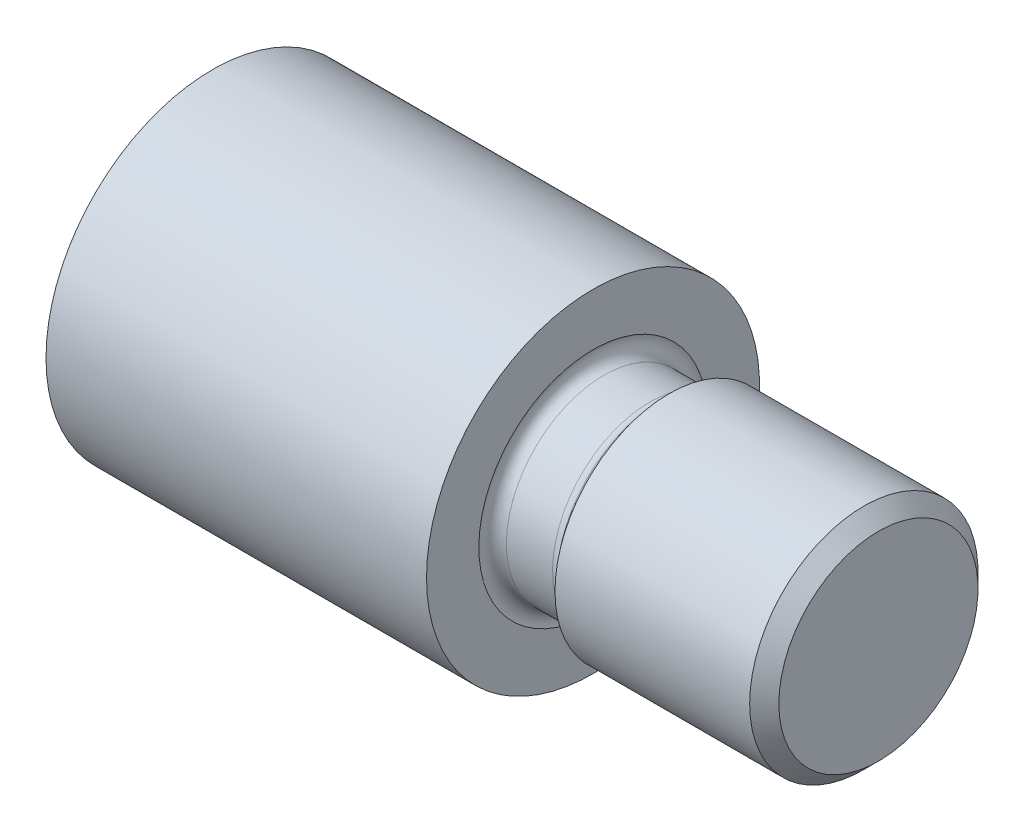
ISO-10303-21;
HEADER;
FILE_DESCRIPTION(('STEP AP214'),'2;1');
FILE_NAME('part.step','',(''),(''),'','','');
FILE_SCHEMA(('AUTOMOTIVE_DESIGN { 1 0 10303 214 1 1 1 1 }'));
ENDSEC;
DATA;
#1=APPLICATION_CONTEXT('core data for automotive mechanical design processes');
#2=APPLICATION_PROTOCOL_DEFINITION('international standard','automotive_design',2000,#1);
#3=PRODUCT_CONTEXT('',#1,'mechanical');
#4=PRODUCT('Part','Part','',(#3));
#5=PRODUCT_RELATED_PRODUCT_CATEGORY('part','',(#4));
#6=PRODUCT_DEFINITION_FORMATION('','',#4);
#7=PRODUCT_DEFINITION_CONTEXT('part definition',#1,'design');
#8=PRODUCT_DEFINITION('design','',#6,#7);
#9=PRODUCT_DEFINITION_SHAPE('','',#8);
#10=(LENGTH_UNIT() NAMED_UNIT(*) SI_UNIT(.MILLI.,.METRE.));
#11=(NAMED_UNIT(*) PLANE_ANGLE_UNIT() SI_UNIT($,.RADIAN.));
#12=(NAMED_UNIT(*) SI_UNIT($,.STERADIAN.) SOLID_ANGLE_UNIT());
#13=UNCERTAINTY_MEASURE_WITH_UNIT(LENGTH_MEASURE(1.E-05),#10,'distance_accuracy_value','');
#14=(GEOMETRIC_REPRESENTATION_CONTEXT(3) GLOBAL_UNCERTAINTY_ASSIGNED_CONTEXT((#13)) GLOBAL_UNIT_ASSIGNED_CONTEXT((#10,
#11,#12)) REPRESENTATION_CONTEXT('',''));
#15=CARTESIAN_POINT('',(0.,0.,0.));
#16=DIRECTION('',(0.,0.,1.));
#17=DIRECTION('',(1.,0.,0.));
#18=AXIS2_PLACEMENT_3D('',#15,#16,#17);
#19=CARTESIAN_POINT('',(-70.,0.,0.));
#20=DIRECTION('',(1.,0.,0.));
#21=DIRECTION('',(0.,0.,-1.));
#22=AXIS2_PLACEMENT_3D('',#19,#20,#21);
#23=PLANE('',#22);
#24=CARTESIAN_POINT('',(-70.,0.,0.));
#25=DIRECTION('',(-1.,0.,0.));
#26=DIRECTION('',(0.,0.,1.));
#27=AXIS2_PLACEMENT_3D('',#24,#25,#26);
#28=CIRCLE('',#27,35.);
#29=CARTESIAN_POINT('',(-70.,0.,35.));
#30=VERTEX_POINT('',#29);
#31=EDGE_CURVE('E46',#30,#30,#28,.T.);
#32=ORIENTED_EDGE('',*,*,#31,.T.);
#33=EDGE_LOOP('',(#32));
#34=FACE_BOUND('',#33,.T.);
#35=ADVANCED_FACE('F31',(#34),#23,.F.);
#36=CARTESIAN_POINT('',(10.,24.,0.));
#37=DIRECTION('',(-1.,0.,0.));
#38=DIRECTION('',(0.,0.,1.));
#39=AXIS2_PLACEMENT_3D('',#36,#37,#38);
#40=PLANE('',#39);
#41=CARTESIAN_POINT('',(10.,0.,0.));
#42=DIRECTION('',(-1.,0.,0.));
#43=DIRECTION('',(0.,0.,1.));
#44=AXIS2_PLACEMENT_3D('',#41,#42,#43);
#45=CIRCLE('',#44,35.);
#46=CARTESIAN_POINT('',(10.,0.,35.));
#47=VERTEX_POINT('',#46);
#48=EDGE_CURVE('E42',#47,#47,#45,.T.);
#49=ORIENTED_EDGE('',*,*,#48,.F.);
#50=EDGE_LOOP('',(#49));
#51=FACE_BOUND('',#50,.T.);
#52=CARTESIAN_POINT('',(10.,0.,0.));
#53=DIRECTION('',(-1.,0.,0.));
#54=DIRECTION('',(0.,-1.,0.));
#55=AXIS2_PLACEMENT_3D('',#52,#53,#54);
#56=CIRCLE('',#55,24.);
#57=CARTESIAN_POINT('',(10.,-24.,0.));
#58=VERTEX_POINT('',#57);
#59=EDGE_CURVE('E51',#58,#58,#56,.T.);
#60=ORIENTED_EDGE('',*,*,#59,.T.);
#61=EDGE_LOOP('',(#60));
#62=FACE_BOUND('',#61,.T.);
#63=ADVANCED_FACE('F99',(#51,#62),#40,.F.);
#64=CARTESIAN_POINT('',(-69.3934640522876,0.,0.));
#65=DIRECTION('',(-1.,0.,0.));
#66=DIRECTION('',(0.,0.,1.));
#67=AXIS2_PLACEMENT_3D('',#64,#65,#66);
#68=CYLINDRICAL_SURFACE('',#67,35.);
#69=ORIENTED_EDGE('',*,*,#31,.F.);
#70=EDGE_LOOP('',(#69));
#71=FACE_BOUND('',#70,.T.);
#72=ORIENTED_EDGE('',*,*,#48,.T.);
#73=EDGE_LOOP('',(#72));
#74=FACE_BOUND('',#73,.T.);
#75=ADVANCED_FACE('F104',(#71,#74),#68,.T.);
#76=CARTESIAN_POINT('',(12.2912878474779,0.,0.));
#77=DIRECTION('',(-1.,0.,0.));
#78=DIRECTION('',(0.,-1.,0.));
#79=AXIS2_PLACEMENT_3D('',#76,#77,#78);
#80=TOROIDAL_SURFACE('',#79,23.,2.5);
#81=ORIENTED_EDGE('',*,*,#59,.F.);
#82=EDGE_LOOP('',(#81));
#83=FACE_BOUND('',#82,.T.);
#84=CARTESIAN_POINT('',(12.2912878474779,0.,0.));
#85=DIRECTION('',(-1.,0.,0.));
#86=DIRECTION('',(0.,-1.,0.));
#87=AXIS2_PLACEMENT_3D('',#84,#85,#86);
#88=CIRCLE('',#87,20.5);
#89=CARTESIAN_POINT('',(12.2912878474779,-20.5,0.));
#90=VERTEX_POINT('',#89);
#91=EDGE_CURVE('E63',#90,#90,#88,.T.);
#92=ORIENTED_EDGE('',*,*,#91,.T.);
#93=EDGE_LOOP('',(#92));
#94=FACE_BOUND('',#93,.T.);
#95=ADVANCED_FACE('F67',(#83,#94),#80,.F.);
#96=CARTESIAN_POINT('',(26.,0.,0.));
#97=DIRECTION('',(1.,0.,0.));
#98=DIRECTION('',(0.,1.,0.));
#99=AXIS2_PLACEMENT_3D('',#96,#97,#98);
#100=CONICAL_SURFACE('',#99,24.,0.896427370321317);
#101=CARTESIAN_POINT('',(23.9527528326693,0.,0.));
#102=DIRECTION('',(-1.,0.,0.));
#103=DIRECTION('',(0.,-1.,0.));
#104=AXIS2_PLACEMENT_3D('',#101,#102,#103);
#105=CIRCLE('',#104,21.4389886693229);
#106=CARTESIAN_POINT('',(23.9527528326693,-21.4389886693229,0.));
#107=VERTEX_POINT('',#106);
#108=EDGE_CURVE('E57',#107,#107,#105,.T.);
#109=ORIENTED_EDGE('',*,*,#108,.F.);
#110=EDGE_LOOP('',(#109));
#111=FACE_BOUND('',#110,.T.);
#112=CARTESIAN_POINT('',(26.,0.,0.));
#113=DIRECTION('',(-1.,0.,0.));
#114=DIRECTION('',(0.,-1.,0.));
#115=AXIS2_PLACEMENT_3D('',#112,#113,#114);
#116=CIRCLE('',#115,24.);
#117=CARTESIAN_POINT('',(26.,-24.,0.));
#118=VERTEX_POINT('',#117);
#119=EDGE_CURVE('E54',#118,#118,#116,.T.);
#120=ORIENTED_EDGE('',*,*,#119,.T.);
#121=EDGE_LOOP('',(#120));
#122=FACE_BOUND('',#121,.T.);
#123=ADVANCED_FACE('F79',(#111,#122),#100,.T.);
#124=CARTESIAN_POINT('',(22.,0.,0.));
#125=DIRECTION('',(-1.,0.,0.));
#126=DIRECTION('',(0.,-1.,0.));
#127=AXIS2_PLACEMENT_3D('',#124,#125,#126);
#128=TOROIDAL_SURFACE('',#127,23.,2.5);
#129=CARTESIAN_POINT('',(22.,0.,0.));
#130=DIRECTION('',(-1.,0.,0.));
#131=DIRECTION('',(0.,-1.,0.));
#132=AXIS2_PLACEMENT_3D('',#129,#130,#131);
#133=CIRCLE('',#132,20.5);
#134=CARTESIAN_POINT('',(22.,-20.5,0.));
#135=VERTEX_POINT('',#134);
#136=EDGE_CURVE('E60',#135,#135,#133,.T.);
#137=ORIENTED_EDGE('',*,*,#136,.F.);
#138=EDGE_LOOP('',(#137));
#139=FACE_BOUND('',#138,.T.);
#140=ORIENTED_EDGE('',*,*,#108,.T.);
#141=EDGE_LOOP('',(#140));
#142=FACE_BOUND('',#141,.T.);
#143=ADVANCED_FACE('F73',(#139,#142),#128,.F.);
#144=CARTESIAN_POINT('',(27.8452482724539,0.,0.));
#145=DIRECTION('',(-1.,0.,0.));
#146=DIRECTION('',(0.,-1.,0.));
#147=AXIS2_PLACEMENT_3D('',#144,#145,#146);
#148=CYLINDRICAL_SURFACE('',#147,20.5);
#149=ORIENTED_EDGE('',*,*,#91,.F.);
#150=EDGE_LOOP('',(#149));
#151=FACE_BOUND('',#150,.T.);
#152=ORIENTED_EDGE('',*,*,#136,.T.);
#153=EDGE_LOOP('',(#152));
#154=FACE_BOUND('',#153,.T.);
#155=ADVANCED_FACE('F69',(#151,#154),#148,.T.);
#156=CARTESIAN_POINT('',(70.,0.,0.));
#157=DIRECTION('',(-1.,0.,0.));
#158=DIRECTION('',(0.,0.,1.));
#159=AXIS2_PLACEMENT_3D('',#156,#157,#158);
#160=PLANE('',#159);
#161=CARTESIAN_POINT('',(70.,0.,0.));
#162=DIRECTION('',(-1.,0.,0.));
#163=DIRECTION('',(0.,0.,1.));
#164=AXIS2_PLACEMENT_3D('',#161,#162,#163);
#165=CIRCLE('',#164,20.9349999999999);
#166=CARTESIAN_POINT('',(70.,0.,20.9349999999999));
#167=VERTEX_POINT('',#166);
#168=EDGE_CURVE('E11',#167,#167,#165,.F.);
#169=ORIENTED_EDGE('',*,*,#168,.T.);
#170=EDGE_LOOP('',(#169));
#171=FACE_BOUND('',#170,.T.);
#172=ADVANCED_FACE('F72',(#171),#160,.F.);
#173=CARTESIAN_POINT('',(-69.3934640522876,0.,0.));
#174=DIRECTION('',(-1.,0.,0.));
#175=DIRECTION('',(0.,0.,1.));
#176=AXIS2_PLACEMENT_3D('',#173,#174,#175);
#177=CYLINDRICAL_SURFACE('',#176,24.);
#178=CARTESIAN_POINT('',(66.935,0.,0.));
#179=DIRECTION('',(-1.,0.,0.));
#180=DIRECTION('',(0.,0.,1.));
#181=AXIS2_PLACEMENT_3D('',#178,#179,#180);
#182=CIRCLE('',#181,24.);
#183=CARTESIAN_POINT('',(66.935,0.,24.));
#184=VERTEX_POINT('',#183);
#185=EDGE_CURVE('E38',#184,#184,#182,.T.);
#186=ORIENTED_EDGE('',*,*,#185,.T.);
#187=EDGE_LOOP('',(#186));
#188=FACE_BOUND('',#187,.T.);
#189=ORIENTED_EDGE('',*,*,#119,.F.);
#190=EDGE_LOOP('',(#189));
#191=FACE_BOUND('',#190,.T.);
#192=ADVANCED_FACE('F88',(#188,#191),#177,.T.);
#193=CARTESIAN_POINT('',(66.935,0.,0.));
#194=DIRECTION('',(-1.,0.,0.));
#195=DIRECTION('',(0.,0.,1.));
#196=AXIS2_PLACEMENT_3D('',#193,#194,#195);
#197=CONICAL_SURFACE('',#196,24.,0.785398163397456);
#198=ORIENTED_EDGE('',*,*,#168,.F.);
#199=EDGE_LOOP('',(#198));
#200=FACE_BOUND('',#199,.T.);
#201=ORIENTED_EDGE('',*,*,#185,.F.);
#202=EDGE_LOOP('',(#201));
#203=FACE_BOUND('',#202,.T.);
#204=ADVANCED_FACE('F33',(#200,#203),#197,.T.);
#205=CLOSED_SHELL('',(#35,#63,#75,#95,#123,#143,#155,#172,#192,#204));
#206=MANIFOLD_SOLID_BREP('B2',#205);
#207=ADVANCED_BREP_SHAPE_REPRESENTATION('',(#18,#206),#14);
#208=SHAPE_DEFINITION_REPRESENTATION(#9,#207);
ENDSEC;
END-ISO-10303-21;
